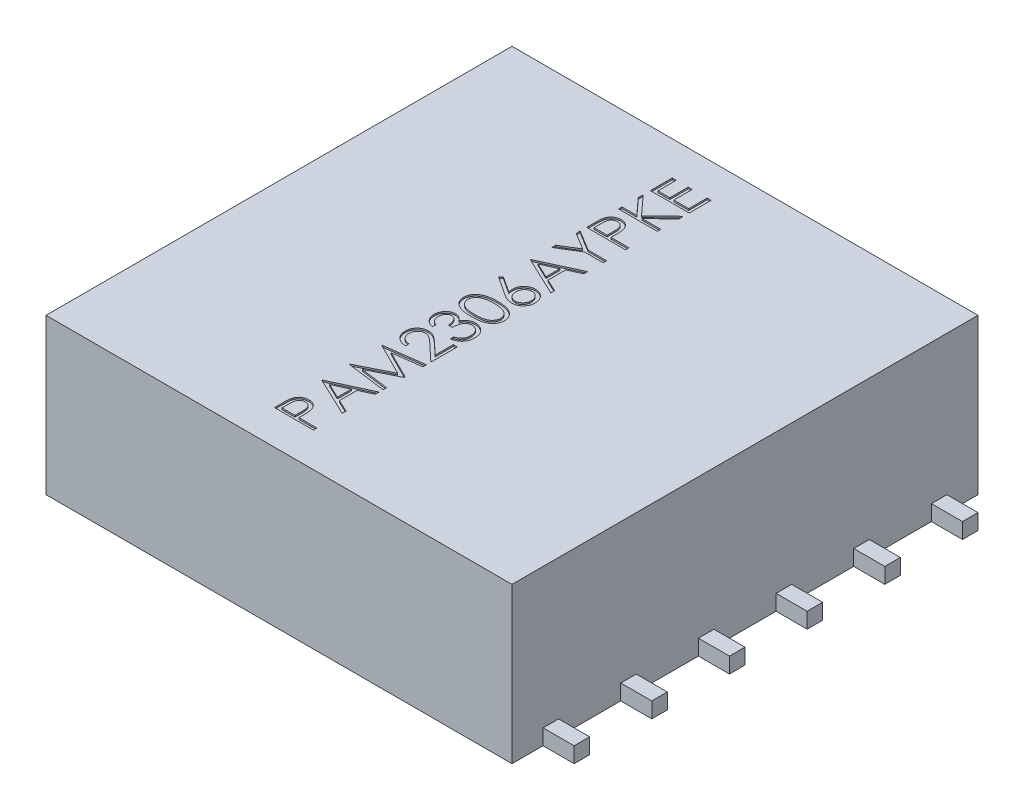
from build123d import *

# Parameters (mm, degrees)
BASES_W                = 3
BASES_H                = 3
BASE_DEPTH             = 1
SOLDERCONNECTIONS_W    = 0.2
SOLDERCONNECTIONS_H    = 0.1
SOLDERCONNECTION_DEPTH = 0.1
SC_LP_COUNT            = 6
SC_LP_PITCH            = 0.5
SC_CP_COUNT            = 2
SC_CP_COPY_1_SKETCH_W  = 0.2
SC_CP_COPY_1_SKETCH_H  = 0.1
SC_CP_COPY_1_DEPTH     = 0.1
SC_CP_COPY_2_SKETCH_W  = 0.2
SC_CP_COPY_2_SKETCH_H  = 0.1
SC_CP_COPY_2_DEPTH     = 0.1
SC_CP_COPY_3_SKETCH_W  = 0.2
SC_CP_COPY_3_SKETCH_H  = 0.1
SC_CP_COPY_3_DEPTH     = 0.1
SC_CP_COPY_4_SKETCH_W  = 0.2
SC_CP_COPY_4_SKETCH_H  = 0.1
SC_CP_COPY_4_DEPTH     = 0.1
SC_CP_COPY_5_SKETCH_W  = 0.2
SC_CP_COPY_5_SKETCH_H  = 0.1
SC_CP_COPY_5_DEPTH     = 0.1
PARTNO_DEPTH           = 0.01


with BuildPart() as part:
    # BaseS → Base (new body)
    with BuildSketch(Plane(origin=(0, 0, 0), x_dir=(1, 0, 0), z_dir=(0, 1, 0))):
        Rectangle(BASES_W, BASES_H)
    extrude(amount=BASE_DEPTH)

    # SolderConnectionS → SolderConnection (add)
    with BuildSketch(Plane(origin=(0, 0, 0), x_dir=(1, 0, 0), z_dir=(0, 1, 0))):
        with Locations((1.6, -1.25)):
            Rectangle(SOLDERCONNECTIONS_W, SOLDERCONNECTIONS_H)
    solderconnection = extrude(amount=SOLDERCONNECTION_DEPTH)

    # SC LP: SolderConnection ×6
    with Locations(*[(0, 0, -i * SC_LP_PITCH) for i in range(1, SC_LP_COUNT)]):
        add(solderconnection)

    # SC CP: SolderConnection ×2 about axis
    sc_cp_axis = Axis((0, 0, 0), (0, 1, 0))
    for i in range(1, SC_CP_COUNT):
        add(solderconnection.rotate(sc_cp_axis, i * 360 / SC_CP_COUNT))

    # SC CP copy 1 sketch → SC CP copy 1 (add)
    with BuildSketch(Plane(origin=(0, 0, 0.5), x_dir=(-1, 0, 0), z_dir=(0, 1, 0))):
        with Locations((1.6, -1.25)):
            Rectangle(SC_CP_COPY_1_SKETCH_W, SC_CP_COPY_1_SKETCH_H)
    extrude(amount=SC_CP_COPY_1_DEPTH)

    # SC CP copy 2 sketch → SC CP copy 2 (add)
    with BuildSketch(Plane(origin=(0, 0, 1), x_dir=(-1, 0, 0), z_dir=(0, 1, 0))):
        with Locations((1.6, -1.25)):
            Rectangle(SC_CP_COPY_2_SKETCH_W, SC_CP_COPY_2_SKETCH_H)
    extrude(amount=SC_CP_COPY_2_DEPTH)

    # SC CP copy 3 sketch → SC CP copy 3 (add)
    with BuildSketch(Plane(origin=(0, 0, 1.5), x_dir=(-1, 0, 0), z_dir=(0, 1, 0))):
        with Locations((1.6, -1.25)):
            Rectangle(SC_CP_COPY_3_SKETCH_W, SC_CP_COPY_3_SKETCH_H)
    extrude(amount=SC_CP_COPY_3_DEPTH)

    # SC CP copy 4 sketch → SC CP copy 4 (add)
    with BuildSketch(Plane(origin=(0, 0, 2), x_dir=(-1, 0, 0), z_dir=(0, 1, 0))):
        with Locations((1.6, -1.25)):
            Rectangle(SC_CP_COPY_4_SKETCH_W, SC_CP_COPY_4_SKETCH_H)
    extrude(amount=SC_CP_COPY_4_DEPTH)

    # SC CP copy 5 sketch → SC CP copy 5 (add)
    with BuildSketch(Plane(origin=(0, 0, 2.5), x_dir=(-1, 0, 0), z_dir=(0, 1, 0))):
        with Locations((1.6, -1.25)):
            Rectangle(SC_CP_COPY_5_SKETCH_W, SC_CP_COPY_5_SKETCH_H)
    extrude(amount=SC_CP_COPY_5_DEPTH)

    # PartNoS → PartNo (cut)
    # profile 1 of 12: a face of its own
    with BuildSketch(Plane(origin=(0, 1, 0), x_dir=(1, 0, 0), z_dir=(0, 1, 0))):
        with BuildLine():
            Line((-0.25, -1.278846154), (-0.25, -1.229817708))
            add(Edge.make_bspline(
                [(-0.25, -1.229817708), (-0.249996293, -1.226445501), (-0.249989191, -1.219984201), (-0.249773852, -1.21071884), (-0.249486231, -1.202303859), (-0.249087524, -1.194757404), (-0.248616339, -1.188056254), (-0.247955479, -1.182230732), (-0.247265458, -1.17723505), (-0.246563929, -1.174241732), (-0.24624399, -1.172876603)],
                knots=[0, 0, 0, 0, 1.415646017, 2.712440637, 3.8905458, 4.950247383, 5.884950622, 6.709939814, 7.411656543, 8, 8, 8, 8], degree=3))
            add(Edge.make_bspline(
                [(-0.24624399, -1.172876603), (-0.245770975, -1.171148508), (-0.244836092, -1.167733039), (-0.242963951, -1.162811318), (-0.240742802, -1.15812971), (-0.238216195, -1.15366732), (-0.23525976, -1.149505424), (-0.232070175, -1.145505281), (-0.228441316, -1.141808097), (-0.224487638, -1.138363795), (-0.220259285, -1.135180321), (-0.215679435, -1.132505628), (-0.210884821, -1.13016696), (-0.205810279, -1.128252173), (-0.200450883, -1.126828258), (-0.194844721, -1.125771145), (-0.188985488, -1.125097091), (-0.184981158, -1.125032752), (-0.182942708, -1.125)],
                knots=[0, 0, 0, 0, 0.999549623, 1.97554611, 2.93413192, 3.889860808, 4.833293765, 5.780583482, 6.742559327, 7.719844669, 8.705620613, 9.691528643, 10.674968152, 11.680406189, 12.713313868, 13.765869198, 14.862690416, 16, 16, 16, 16], degree=3))
            add(Edge.make_bspline(
                [(-0.182942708, -1.125), (-0.180887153, -1.125030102), (-0.17686532, -1.125088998), (-0.170981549, -1.125795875), (-0.165358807, -1.126748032), (-0.160009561, -1.128212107), (-0.154965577, -1.130129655), (-0.150149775, -1.132379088), (-0.145644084, -1.135092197), (-0.141432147, -1.138209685), (-0.13751001, -1.141677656), (-0.133906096, -1.145481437), (-0.130641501, -1.149605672), (-0.127708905, -1.154037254), (-0.125176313, -1.158819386), (-0.122907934, -1.16387954), (-0.121002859, -1.169261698), (-0.120000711, -1.172986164), (-0.119491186, -1.174879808)],
                knots=[0, 0, 0, 0, 1.121902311, 2.195077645, 3.232258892, 4.234102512, 5.217864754, 6.176164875, 7.132989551, 8.084763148, 9.034132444, 9.988522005, 10.94243251, 11.903244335, 12.886203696, 13.894208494, 14.929344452, 16, 16, 16, 16], degree=3))
            add(Edge.make_bspline(
                [(-0.119491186, -1.174879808), (-0.119158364, -1.176446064), (-0.118428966, -1.179878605), (-0.117609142, -1.185531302), (-0.116936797, -1.192116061), (-0.11630936, -1.199610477), (-0.115976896, -1.208032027), (-0.11558653, -1.217361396), (-0.115402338, -1.227630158), (-0.115390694, -1.2347923), (-0.115384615, -1.238531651)],
                knots=[0, 0, 0, 0, 0.601372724, 1.317943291, 2.144091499, 3.08771165, 4.142394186, 5.309582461, 6.595334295, 8, 8, 8, 8], degree=3))
            Line((-0.115384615, -1.238531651), (-0.115384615, -1.256410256))
            Line((-0.115384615, -1.256410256), (0, -1.256410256))
            Line((0, -1.256410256), (0, -1.278846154))
            Line((0, -1.278846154), (-0.25, -1.278846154))
        make_face()
        with BuildLine():
            Line((-0.224358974, -1.256410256), (-0.141025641, -1.256410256))
            Line((-0.141025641, -1.256410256), (-0.14047476, -1.212640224))
            add(Edge.make_bspline(
                [(-0.14047476, -1.212640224), (-0.140473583, -1.210503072), (-0.140471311, -1.206377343), (-0.140756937, -1.200417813), (-0.141082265, -1.1948879), (-0.141574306, -1.189808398), (-0.142219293, -1.185161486), (-0.1430214, -1.180987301), (-0.143893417, -1.177223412), (-0.145350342, -1.172893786), (-0.147590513, -1.168027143), (-0.150851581, -1.162710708), (-0.15507614, -1.158239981), (-0.159812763, -1.154378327), (-0.165067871, -1.151253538), (-0.170720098, -1.149049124), (-0.176685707, -1.147691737), (-0.180765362, -1.147522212), (-0.182842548, -1.147435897)],
                knots=[0, 0, 0, 0, 1.160746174, 2.240796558, 3.240300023, 4.169675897, 5.012224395, 5.787635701, 6.478238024, 7.109103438, 8.265591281, 9.382545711, 10.479929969, 11.588830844, 12.694575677, 13.785760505, 14.872603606, 16, 16, 16, 16], degree=3))
            add(Edge.make_bspline(
                [(-0.182842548, -1.147435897), (-0.18485244, -1.147526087), (-0.188847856, -1.147705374), (-0.194703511, -1.149037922), (-0.200291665, -1.151277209), (-0.205504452, -1.154381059), (-0.210230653, -1.158148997), (-0.214343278, -1.162524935), (-0.217627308, -1.167520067), (-0.219828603, -1.172127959), (-0.221117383, -1.176254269), (-0.222048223, -1.179820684), (-0.2226901, -1.183868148), (-0.223304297, -1.188358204), (-0.223800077, -1.193285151), (-0.224144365, -1.198680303), (-0.224343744, -1.204525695), (-0.224353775, -1.208583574), (-0.224358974, -1.210687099)],
                knots=[0, 0, 0, 0, 1.120540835, 2.227496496, 3.330685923, 4.466139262, 5.598993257, 6.692710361, 7.80064471, 8.921224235, 9.527843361, 10.209888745, 10.975318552, 11.811557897, 12.738105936, 13.73658638, 14.826690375, 16, 16, 16, 16], degree=3))
            Line((-0.224358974, -1.210687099), (-0.224358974, -1.256410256))
        make_face(mode=Mode.SUBTRACT)
    # profile 2 of 12: a face of its own
    with BuildSketch(Plane(origin=(0, 1, 0), x_dir=(1, 0, 0), z_dir=(0, 1, 0))):
        Polygon((-0.25, -0.971153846), (0, -0.855769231), (0, -0.880158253), (-0.080128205, -0.917117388), (-0.080128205, -1.030448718), (0, -1.068459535), (0, -1.092948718), (-0.25, -0.974358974), align=None)
        Polygon((-0.201272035, -0.973006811), (-0.105769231, -1.018279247), (-0.105769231, -0.928936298), align=None, mode=Mode.SUBTRACT)
    # profile 3 of 12: a face of its own
    with BuildSketch(Plane(origin=(0, 1, 0), x_dir=(1, 0, 0), z_dir=(0, 1, 0))):
        Polygon((0, -0.830128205), (-0.25, -0.797125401), (-0.25, -0.793920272), (-0.044871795, -0.690705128), (-0.25, -0.587740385), (-0.25, -0.584485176), (0, -0.551282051), (0, -0.573818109), (-0.179887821, -0.59775641), (0, -0.688000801), (0, -0.693058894), (-0.180288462, -0.783653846), (0, -0.807542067), align=None)
    # profile 4 of 12: a face of its own
    with BuildSketch(Plane(origin=(0, 1, 0), x_dir=(1, 0, 0), z_dir=(0, 1, 0))):
        with BuildLine():
            Line((-0.173076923, -0.490384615), (-0.173076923, -0.512820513))
            add(Edge.make_bspline(
                [(-0.173076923, -0.512820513), (-0.176053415, -0.512674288), (-0.181899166, -0.512387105), (-0.190422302, -0.511042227), (-0.198569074, -0.509117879), (-0.206274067, -0.506397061), (-0.213605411, -0.503018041), (-0.220533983, -0.498965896), (-0.227033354, -0.494166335), (-0.233043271, -0.488722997), (-0.238556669, -0.482810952), (-0.243317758, -0.476431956), (-0.247340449, -0.46972874), (-0.250703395, -0.46272164), (-0.253227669, -0.4553316), (-0.255100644, -0.447625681), (-0.256227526, -0.439570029), (-0.256348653, -0.434081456), (-0.256410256, -0.431290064)],
                knots=[0, 0, 0, 0, 1.10065271, 2.161652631, 3.183658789, 4.190468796, 5.17591951, 6.163126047, 7.15150782, 8.156236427, 9.156009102, 10.134482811, 11.092018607, 12.041330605, 13.001268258, 13.972401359, 14.968799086, 16, 16, 16, 16], degree=3))
            add(Edge.make_bspline(
                [(-0.256410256, -0.431290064), (-0.256346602, -0.42854858), (-0.256221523, -0.423161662), (-0.255131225, -0.415302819), (-0.25346044, -0.407803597), (-0.250984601, -0.400748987), (-0.247877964, -0.394066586), (-0.244014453, -0.387839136), (-0.239576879, -0.381916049), (-0.234342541, -0.37658802), (-0.22875749, -0.371693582), (-0.222792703, -0.367474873), (-0.216624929, -0.363841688), (-0.210205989, -0.360868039), (-0.20351498, -0.358613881), (-0.196616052, -0.356943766), (-0.189429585, -0.355989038), (-0.184564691, -0.355843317), (-0.182091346, -0.355769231)],
                knots=[0, 0, 0, 0, 1.111674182, 2.184400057, 3.212814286, 4.223731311, 5.211378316, 6.196328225, 7.191884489, 8.207283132, 9.220262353, 10.201199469, 11.166417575, 12.120932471, 13.06540007, 14.026332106, 14.996573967, 16, 16, 16, 16], degree=3))
            add(Edge.make_bspline(
                [(-0.182091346, -0.355769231), (-0.178609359, -0.35589018), (-0.17170649, -0.356129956), (-0.161562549, -0.358180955), (-0.151734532, -0.361384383), (-0.143824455, -0.365240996), (-0.137451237, -0.369132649), (-0.132201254, -0.372636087), (-0.126549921, -0.376760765), (-0.120474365, -0.381471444), (-0.114054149, -0.386849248), (-0.107158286, -0.392754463), (-0.099914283, -0.399339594), (-0.094963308, -0.403957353), (-0.092397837, -0.40635016)],
                knots=[0, 0, 0, 0, 1.184416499, 2.348048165, 3.509039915, 4.696071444, 5.333504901, 6.05069495, 6.844171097, 7.714965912, 8.667477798, 9.695072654, 10.805644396, 12, 12, 12, 12], degree=3))
            Line((-0.092397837, -0.40635016), (-0.025641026, -0.46890024))
            Line((-0.025641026, -0.46890024), (-0.025641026, -0.352564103))
            Line((-0.025641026, -0.352564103), (0, -0.352564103))
            Line((0, -0.352564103), (0, -0.522435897))
            Line((0, -0.522435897), (-0.103465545, -0.425480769))
            add(Edge.make_bspline(
                [(-0.103465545, -0.425480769), (-0.10592971, -0.423120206), (-0.110662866, -0.418586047), (-0.117573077, -0.412173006), (-0.123983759, -0.406413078), (-0.129882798, -0.401268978), (-0.135356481, -0.396852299), (-0.140227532, -0.392932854), (-0.144709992, -0.389792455), (-0.14990575, -0.386384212), (-0.156249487, -0.383083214), (-0.164001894, -0.380246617), (-0.171982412, -0.378516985), (-0.177375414, -0.378309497), (-0.180088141, -0.378205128)],
                knots=[0, 0, 0, 0, 1.329631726, 2.553950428, 3.673215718, 4.687767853, 5.603093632, 6.413772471, 7.123043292, 7.734684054, 8.834405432, 9.900288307, 10.943827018, 12, 12, 12, 12], degree=3))
            add(Edge.make_bspline(
                [(-0.180088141, -0.378205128), (-0.181793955, -0.378250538), (-0.185155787, -0.378340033), (-0.19008477, -0.379129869), (-0.1948394, -0.380323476), (-0.199434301, -0.382033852), (-0.203823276, -0.384291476), (-0.208011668, -0.387039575), (-0.212060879, -0.390210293), (-0.215857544, -0.393878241), (-0.219334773, -0.397907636), (-0.222415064, -0.402164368), (-0.224989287, -0.406667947), (-0.227099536, -0.411399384), (-0.228754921, -0.416345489), (-0.229901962, -0.421515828), (-0.23062214, -0.426896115), (-0.23071958, -0.430569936), (-0.230769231, -0.432441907)],
                knots=[0, 0, 0, 0, 0.991446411, 1.95395049, 2.89581595, 3.838931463, 4.798493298, 5.75982156, 6.748411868, 7.785213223, 8.824556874, 9.840280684, 10.836137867, 11.835679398, 12.848801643, 13.863922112, 14.911575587, 16, 16, 16, 16], degree=3))
            add(Edge.make_bspline(
                [(-0.230769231, -0.432441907), (-0.230720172, -0.434397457), (-0.23062383, -0.438237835), (-0.229894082, -0.443864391), (-0.228787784, -0.449268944), (-0.227030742, -0.454370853), (-0.22495471, -0.459280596), (-0.222317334, -0.463893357), (-0.219252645, -0.468285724), (-0.215699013, -0.47238545), (-0.211706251, -0.476129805), (-0.207305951, -0.47946597), (-0.202529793, -0.482361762), (-0.197397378, -0.484891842), (-0.191857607, -0.486945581), (-0.185931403, -0.48851516), (-0.179644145, -0.489757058), (-0.175302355, -0.490171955), (-0.173076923, -0.490384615)],
                knots=[0, 0, 0, 0, 1.030878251, 2.024474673, 2.987898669, 3.934362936, 4.864849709, 5.795128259, 6.730474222, 7.685293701, 8.650606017, 9.611896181, 10.591709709, 11.591680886, 12.625074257, 13.701333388, 14.821793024, 16, 16, 16, 16], degree=3))
        make_face()
    # profile 5 of 12: a face of its own
    with BuildSketch(Plane(origin=(0, 1, 0), x_dir=(1, 0, 0), z_dir=(0, 1, 0))):
        with BuildLine():
            Line((-0.192307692, -0.298076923), (-0.192307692, -0.320512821))
            add(Edge.make_bspline(
                [(-0.192307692, -0.320512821), (-0.194824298, -0.319904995), (-0.199744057, -0.318716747), (-0.206773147, -0.316238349), (-0.213424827, -0.313538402), (-0.219574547, -0.310296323), (-0.225345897, -0.306759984), (-0.230607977, -0.302708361), (-0.235494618, -0.298328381), (-0.239831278, -0.293483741), (-0.243758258, -0.288403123), (-0.247106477, -0.283014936), (-0.249986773, -0.277427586), (-0.252359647, -0.271602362), (-0.254147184, -0.265521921), (-0.255444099, -0.259241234), (-0.256286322, -0.252743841), (-0.256368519, -0.248333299), (-0.256410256, -0.24609375)],
                knots=[0, 0, 0, 0, 1.162005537, 2.271625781, 3.343758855, 4.383309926, 5.390229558, 6.379919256, 7.361854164, 8.333198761, 9.295911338, 10.242430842, 11.177959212, 12.116337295, 13.062827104, 14.020064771, 14.994644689, 16, 16, 16, 16], degree=3))
            add(Edge.make_bspline(
                [(-0.256410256, -0.24609375), (-0.25631174, -0.242830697), (-0.256116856, -0.236375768), (-0.254337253, -0.226892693), (-0.251521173, -0.21774792), (-0.247630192, -0.209041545), (-0.242831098, -0.200954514), (-0.237119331, -0.193759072), (-0.230605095, -0.18755275), (-0.223409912, -0.182346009), (-0.215720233, -0.178269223), (-0.207805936, -0.175263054), (-0.199685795, -0.173432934), (-0.194203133, -0.173195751), (-0.19145633, -0.173076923)],
                knots=[0, 0, 0, 0, 1.083050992, 2.142477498, 3.193116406, 4.255571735, 5.30263384, 6.308962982, 7.297363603, 8.282367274, 9.249857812, 10.179914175, 11.08814088, 12, 12, 12, 12], degree=3))
            add(Edge.make_bspline(
                [(-0.19145633, -0.173076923), (-0.188812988, -0.173160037), (-0.183640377, -0.173322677), (-0.176088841, -0.174703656), (-0.168971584, -0.177027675), (-0.162258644, -0.180246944), (-0.155992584, -0.184414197), (-0.150159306, -0.189462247), (-0.144732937, -0.195426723), (-0.141624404, -0.199946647), (-0.140024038, -0.202273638)],
                knots=[0, 0, 0, 0, 1.024540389, 2.004866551, 2.965041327, 3.920577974, 4.882998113, 5.874504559, 6.905732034, 8, 8, 8, 8], degree=3))
            add(Edge.make_bspline(
                [(-0.140024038, -0.202273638), (-0.138744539, -0.199610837), (-0.136205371, -0.194326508), (-0.131146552, -0.187196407), (-0.125449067, -0.180625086), (-0.120953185, -0.177003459), (-0.118689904, -0.175180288)],
                knots=[0, 0, 0, 0, 1.015663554, 2.015584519, 3.001021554, 4, 4, 4, 4], degree=3))
            add(Edge.make_bspline(
                [(-0.118689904, -0.175180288), (-0.117042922, -0.173977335), (-0.113775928, -0.171591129), (-0.108523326, -0.168645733), (-0.103212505, -0.165973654), (-0.097701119, -0.163891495), (-0.092053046, -0.162279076), (-0.08625859, -0.161126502), (-0.080313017, -0.160410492), (-0.076290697, -0.160307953), (-0.07426883, -0.16025641)],
                knots=[0, 0, 0, 0, 1.025084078, 2.033381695, 3.024893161, 4.013698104, 4.991890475, 5.976764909, 6.982997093, 8, 8, 8, 8], degree=3))
            add(Edge.make_bspline(
                [(-0.07426883, -0.16025641), (-0.070768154, -0.160384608), (-0.063783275, -0.160640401), (-0.053463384, -0.162926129), (-0.043376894, -0.166471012), (-0.033724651, -0.17149948), (-0.024702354, -0.17765549), (-0.016570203, -0.184898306), (-0.009689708, -0.193331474), (-0.003871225, -0.20264936), (0.000736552, -0.212787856), (0.004057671, -0.223587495), (0.006049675, -0.234985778), (0.006288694, -0.242780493), (0.006410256, -0.246744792)],
                knots=[0, 0, 0, 0, 0.955697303, 1.906897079, 2.875188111, 3.870982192, 4.871999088, 5.854111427, 6.836107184, 7.836239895, 8.848948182, 9.870701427, 10.917064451, 12, 12, 12, 12], degree=3))
            add(Edge.make_bspline(
                [(0.006410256, -0.246744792), (0.0063477, -0.249417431), (0.006224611, -0.254676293), (0.005398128, -0.262410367), (0.003847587, -0.269777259), (0.001897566, -0.276848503), (-0.000798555, -0.283517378), (-0.004012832, -0.289879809), (-0.007827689, -0.295907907), (-0.012249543, -0.301565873), (-0.017199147, -0.306847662), (-0.022758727, -0.311618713), (-0.028824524, -0.315931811), (-0.0354511, -0.319759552), (-0.042619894, -0.323118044), (-0.050359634, -0.325935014), (-0.058610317, -0.328394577), (-0.064358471, -0.329540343), (-0.067307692, -0.330128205)],
                knots=[0, 0, 0, 0, 1.048603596, 2.063302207, 3.045874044, 3.999447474, 4.937100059, 5.862643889, 6.7929026, 7.7308982, 8.676022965, 9.627908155, 10.600123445, 11.591992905, 12.626222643, 13.701663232, 14.820785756, 16, 16, 16, 16], degree=3))
            Line((-0.067307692, -0.330128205), (-0.067307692, -0.307692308))
            add(Edge.make_bspline(
                [(-0.067307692, -0.307692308), (-0.065382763, -0.307107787), (-0.061638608, -0.305970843), (-0.056250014, -0.304035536), (-0.051310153, -0.30183066), (-0.046782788, -0.299465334), (-0.04262333, -0.296981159), (-0.038941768, -0.294201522), (-0.035576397, -0.291332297), (-0.033680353, -0.289169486), (-0.032752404, -0.288110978)],
                knots=[0, 0, 0, 0, 1.198163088, 2.33053128, 3.407730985, 4.417276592, 5.372219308, 6.28897303, 7.162600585, 8, 8, 8, 8], degree=3))
            add(Edge.make_bspline(
                [(-0.032752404, -0.288110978), (-0.031673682, -0.286711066), (-0.029519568, -0.283915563), (-0.026762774, -0.279363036), (-0.024403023, -0.27455842), (-0.022484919, -0.269461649), (-0.021045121, -0.264072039), (-0.020008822, -0.258411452), (-0.019324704, -0.252470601), (-0.019262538, -0.248416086), (-0.019230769, -0.246344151)],
                knots=[0, 0, 0, 0, 0.946083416, 1.889246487, 2.84504177, 3.809995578, 4.801312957, 5.829064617, 6.89060985, 8, 8, 8, 8], degree=3))
            add(Edge.make_bspline(
                [(-0.019230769, -0.246344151), (-0.019274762, -0.244004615), (-0.019360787, -0.239429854), (-0.020151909, -0.232754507), (-0.021304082, -0.226403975), (-0.023083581, -0.220448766), (-0.025282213, -0.214810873), (-0.028042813, -0.209569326), (-0.031281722, -0.204655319), (-0.03496309, -0.20013179), (-0.038993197, -0.196064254), (-0.043208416, -0.19248286), (-0.047590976, -0.189438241), (-0.052165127, -0.186982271), (-0.056911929, -0.185042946), (-0.061844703, -0.183722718), (-0.066923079, -0.182804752), (-0.070375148, -0.182729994), (-0.072115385, -0.182692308)],
                knots=[0, 0, 0, 0, 1.217147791, 2.380027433, 3.494444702, 4.572153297, 5.609568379, 6.639424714, 7.649109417, 8.668170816, 9.669597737, 10.625200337, 11.543417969, 12.441394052, 13.322311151, 14.205496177, 15.095365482, 16, 16, 16, 16], degree=3))
            add(Edge.make_bspline(
                [(-0.072115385, -0.182692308), (-0.074444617, -0.182801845), (-0.079091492, -0.183020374), (-0.085930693, -0.184681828), (-0.092522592, -0.187439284), (-0.098781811, -0.191223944), (-0.104512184, -0.195943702), (-0.1096616, -0.201375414), (-0.11390661, -0.207666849), (-0.116842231, -0.213453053), (-0.118844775, -0.21857927), (-0.120178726, -0.222966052), (-0.121308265, -0.227877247), (-0.122359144, -0.233253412), (-0.123253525, -0.239135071), (-0.123999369, -0.245515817), (-0.124596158, -0.252396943), (-0.124862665, -0.257160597), (-0.125, -0.259615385)],
                knots=[0, 0, 0, 0, 1.070505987, 2.135685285, 3.216438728, 4.346150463, 5.486482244, 6.621737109, 7.7759408, 8.963942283, 9.59839197, 10.305095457, 11.070459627, 11.915156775, 12.823989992, 13.805807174, 14.869297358, 16, 16, 16, 16], degree=3))
            Line((-0.125, -0.259615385), (-0.150641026, -0.259615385))
            add(Edge.make_bspline(
                [(-0.150641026, -0.259615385), (-0.150701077, -0.256523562), (-0.150818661, -0.250469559), (-0.151955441, -0.241602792), (-0.153780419, -0.233160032), (-0.156387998, -0.225262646), (-0.159459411, -0.218078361), (-0.163008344, -0.21182038), (-0.167025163, -0.206653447), (-0.171432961, -0.202523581), (-0.176134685, -0.199384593), (-0.181065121, -0.197127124), (-0.186243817, -0.19578167), (-0.189779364, -0.195602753), (-0.19155649, -0.195512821)],
                knots=[0, 0, 0, 0, 1.322091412, 2.58874672, 3.817242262, 5.011895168, 6.140903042, 7.155122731, 8.080855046, 8.929742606, 9.727943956, 10.488587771, 11.240295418, 12, 12, 12, 12], degree=3))
            add(Edge.make_bspline(
                [(-0.19155649, -0.195512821), (-0.192862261, -0.195541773), (-0.195460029, -0.195599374), (-0.199267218, -0.196354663), (-0.202957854, -0.197437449), (-0.206489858, -0.199009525), (-0.209870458, -0.201046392), (-0.213136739, -0.203503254), (-0.216246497, -0.206450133), (-0.219215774, -0.209750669), (-0.221916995, -0.213405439), (-0.224281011, -0.21732919), (-0.226286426, -0.221506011), (-0.227945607, -0.225909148), (-0.229192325, -0.230559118), (-0.230087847, -0.235432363), (-0.23064765, -0.240538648), (-0.230728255, -0.24402234), (-0.230769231, -0.245793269)],
                knots=[0, 0, 0, 0, 0.884325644, 1.759323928, 2.622595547, 3.489424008, 4.37295195, 5.294616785, 6.255907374, 7.274251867, 8.302369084, 9.333474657, 10.37669385, 11.44084034, 12.520297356, 13.637342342, 14.798947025, 16, 16, 16, 16], degree=3))
            add(Edge.make_bspline(
                [(-0.230769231, -0.245793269), (-0.230669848, -0.248639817), (-0.23047573, -0.254199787), (-0.228775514, -0.262215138), (-0.226062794, -0.269666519), (-0.222824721, -0.275362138), (-0.219628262, -0.279568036), (-0.216836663, -0.282573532), (-0.213734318, -0.285524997), (-0.210130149, -0.288228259), (-0.206268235, -0.290962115), (-0.201952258, -0.293451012), (-0.197294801, -0.295869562), (-0.194002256, -0.297326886), (-0.192307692, -0.298076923)],
                knots=[0, 0, 0, 0, 1.472543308, 2.876219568, 4.221790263, 5.565193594, 6.249813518, 6.953379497, 7.687249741, 8.463570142, 9.283606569, 10.136032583, 11.040678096, 12, 12, 12, 12], degree=3))
        make_face()
    # profile 6 of 12: a face of its own
    with BuildSketch(Plane(origin=(0, 1, 0), x_dir=(1, 0, 0), z_dir=(0, 1, 0))):
        with BuildLine():
            add(Edge.make_bspline(
                [(-0.12489984, -0.137820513), (-0.128906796, -0.137797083), (-0.136690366, -0.13775157), (-0.148032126, -0.137245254), (-0.158672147, -0.136404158), (-0.168610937, -0.135251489), (-0.177851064, -0.133848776), (-0.186367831, -0.131976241), (-0.194200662, -0.129846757), (-0.201375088, -0.127378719), (-0.207987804, -0.124593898), (-0.214160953, -0.121562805), (-0.219885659, -0.118165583), (-0.225251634, -0.114594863), (-0.230176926, -0.110711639), (-0.234718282, -0.106599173), (-0.238837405, -0.102175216), (-0.242537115, -0.097482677), (-0.245781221, -0.092553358), (-0.248656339, -0.08752196), (-0.251024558, -0.082298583), (-0.252961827, -0.076951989), (-0.254543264, -0.07147091), (-0.255629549, -0.065856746), (-0.256311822, -0.060096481), (-0.256377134, -0.056208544), (-0.256410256, -0.054236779)],
                knots=[0, 0, 0, 0, 1.646148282, 3.197666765, 4.66315463, 6.030252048, 7.307778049, 8.501004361, 9.610818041, 10.641065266, 11.615491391, 12.557119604, 13.464013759, 14.348536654, 15.203310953, 16.038349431, 16.863300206, 17.683791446, 18.490318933, 19.285717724, 20.06220424, 20.843281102, 21.620494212, 22.403315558, 23.190242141, 24, 24, 24, 24], degree=3))
            add(Edge.make_bspline(
                [(-0.256410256, -0.054236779), (-0.256382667, -0.052247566), (-0.256327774, -0.048289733), (-0.255555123, -0.042459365), (-0.254557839, -0.036730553), (-0.252958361, -0.031190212), (-0.251044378, -0.025733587), (-0.248518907, -0.020496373), (-0.245772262, -0.015293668), (-0.242421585, -0.010361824), (-0.238718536, -0.005553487), (-0.234514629, -0.001046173), (-0.229926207, 0.003275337), (-0.224850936, 0.007247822), (-0.219366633, 0.011041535), (-0.213427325, 0.014512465), (-0.207046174, 0.017732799), (-0.200252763, 0.020763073), (-0.192865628, 0.023412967), (-0.184930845, 0.025768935), (-0.176376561, 0.027700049), (-0.167250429, 0.029297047), (-0.157507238, 0.030536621), (-0.147166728, 0.031438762), (-0.136222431, 0.031915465), (-0.128739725, 0.032005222), (-0.12489984, 0.032051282)],
                knots=[0, 0, 0, 0, 0.810910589, 1.61342667, 2.396193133, 3.181089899, 3.963115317, 4.752255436, 5.550715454, 6.36105385, 7.181178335, 8.024612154, 8.872680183, 9.750181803, 10.651284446, 11.591556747, 12.554036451, 13.566402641, 14.62422919, 15.753422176, 16.94128843, 18.199818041, 19.531985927, 20.947085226, 22.433341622, 24, 24, 24, 24], degree=3))
            add(Edge.make_bspline(
                [(-0.12489984, 0.032051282), (-0.121076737, 0.032004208), (-0.113610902, 0.031912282), (-0.102715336, 0.031448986), (-0.092430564, 0.030514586), (-0.082745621, 0.02936282), (-0.073656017, 0.027747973), (-0.065167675, 0.025802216), (-0.057250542, 0.023585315), (-0.049961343, 0.020894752), (-0.04317972, 0.01793501), (-0.03684549, 0.014718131), (-0.03090775, 0.011266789), (-0.025408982, 0.007529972), (-0.020354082, 0.003492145), (-0.015749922, -0.000826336), (-0.011519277, -0.005373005), (-0.007775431, -0.010209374), (-0.004399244, -0.015187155), (-0.001552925, -0.020390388), (0.000913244, -0.02568591), (0.002929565, -0.03112659), (0.004493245, -0.036704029), (0.00556819, -0.042436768), (0.006323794, -0.048290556), (0.006381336, -0.052247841), (0.006410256, -0.054236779)],
                knots=[0, 0, 0, 0, 1.561645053, 3.049612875, 4.452756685, 5.778837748, 7.032101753, 8.221335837, 9.334924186, 10.387562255, 11.392109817, 12.355697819, 13.287721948, 14.19548756, 15.068665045, 15.927346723, 16.771751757, 17.602390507, 18.423119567, 19.225778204, 20.022010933, 20.807278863, 21.593079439, 22.384715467, 23.188155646, 24, 24, 24, 24], degree=3))
            add(Edge.make_bspline(
                [(0.006410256, -0.054236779), (0.006376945, -0.056208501), (0.006311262, -0.060096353), (0.00563171, -0.065857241), (0.004539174, -0.071448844), (0.003009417, -0.076898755), (0.001136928, -0.082234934), (-0.001302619, -0.087384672), (-0.004112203, -0.092405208), (-0.007311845, -0.097283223), (-0.010977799, -0.101926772), (-0.015031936, -0.106363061), (-0.019578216, -0.110476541), (-0.024545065, -0.114326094), (-0.029919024, -0.117934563), (-0.0357037, -0.121302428), (-0.041908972, -0.124397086), (-0.048573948, -0.127229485), (-0.055799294, -0.129740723), (-0.063652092, -0.131950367), (-0.072212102, -0.133715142), (-0.081435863, -0.135211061), (-0.091342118, -0.136409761), (-0.10193445, -0.137244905), (-0.113192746, -0.137751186), (-0.120926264, -0.137796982), (-0.12489984, -0.137820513)],
                knots=[0, 0, 0, 0, 0.810927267, 1.598990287, 2.382942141, 3.152806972, 3.926217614, 4.706701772, 5.493896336, 6.292070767, 7.104102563, 7.925577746, 8.761822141, 9.623241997, 10.509042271, 11.423174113, 12.375371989, 13.360203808, 14.400680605, 15.520553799, 16.714061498, 17.994519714, 19.364400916, 20.818312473, 22.365209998, 24, 24, 24, 24], degree=3))
        make_face()
        with BuildLine():
            add(Edge.make_bspline(
                [(-0.125, -0.115384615), (-0.121660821, -0.115375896), (-0.115180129, -0.115358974), (-0.105779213, -0.114929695), (-0.096996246, -0.114332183), (-0.088834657, -0.113580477), (-0.081322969, -0.112454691), (-0.074429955, -0.111177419), (-0.068168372, -0.109645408), (-0.062483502, -0.107823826), (-0.057294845, -0.105748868), (-0.052464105, -0.103487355), (-0.047934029, -0.101036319), (-0.043715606, -0.098345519), (-0.039860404, -0.095361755), (-0.036270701, -0.092223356), (-0.033071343, -0.088788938), (-0.029233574, -0.084038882), (-0.025267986, -0.077767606), (-0.021814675, -0.069866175), (-0.019644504, -0.061746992), (-0.019368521, -0.056236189), (-0.019230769, -0.053485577)],
                knots=[0, 0, 0, 0, 1.459098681, 2.831824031, 4.11146945, 5.306290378, 6.412266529, 7.42953815, 8.369053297, 9.227277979, 10.03601793, 10.809473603, 11.557037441, 12.285528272, 12.993193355, 13.685654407, 14.36688038, 15.041354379, 16.352855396, 17.594313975, 18.799247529, 20, 20, 20, 20], degree=3))
            add(Edge.make_bspline(
                [(-0.019230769, -0.053485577), (-0.019351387, -0.050719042), (-0.019592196, -0.045195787), (-0.021693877, -0.037084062), (-0.025110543, -0.029274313), (-0.029014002, -0.023110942), (-0.032755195, -0.018434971), (-0.035941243, -0.015083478), (-0.039509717, -0.012007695), (-0.043359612, -0.009090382), (-0.047564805, -0.00641474), (-0.052104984, -0.003981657), (-0.056992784, -0.001761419), (-0.060404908, -0.000496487), (-0.062149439, 0.00015024)],
                knots=[0, 0, 0, 0, 1.353621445, 2.702441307, 4.075953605, 5.516772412, 6.261413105, 7.007624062, 7.778524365, 8.566925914, 9.372323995, 10.217594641, 11.088702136, 12, 12, 12, 12], degree=3))
            add(Edge.make_bspline(
                [(-0.062149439, 0.00015024), (-0.064380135, 0.000903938), (-0.068909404, 0.002434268), (-0.075935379, 0.004406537), (-0.083307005, 0.00595978), (-0.090980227, 0.007357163), (-0.099011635, 0.008310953), (-0.107376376, 0.009078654), (-0.116080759, 0.009530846), (-0.121994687, 0.0095869), (-0.125, 0.009615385)],
                knots=[0, 0, 0, 0, 0.884706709, 1.796334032, 2.740027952, 3.714592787, 4.726048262, 5.777819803, 6.87074269, 8, 8, 8, 8], degree=3))
            add(Edge.make_bspline(
                [(-0.125, 0.009615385), (-0.128004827, 0.009576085), (-0.13388291, 0.009499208), (-0.142491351, 0.009205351), (-0.15066762, 0.008446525), (-0.158446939, 0.00760373), (-0.165786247, 0.006361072), (-0.172746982, 0.005021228), (-0.179242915, 0.003221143), (-0.185375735, 0.001298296), (-0.191075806, -0.000902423), (-0.196369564, -0.003325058), (-0.201283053, -0.00591204), (-0.205801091, -0.0087232), (-0.209949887, -0.01171938), (-0.213633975, -0.015008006), (-0.217032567, -0.018380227), (-0.220842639, -0.023176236), (-0.224758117, -0.029404), (-0.228263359, -0.037206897), (-0.230337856, -0.045282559), (-0.230625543, -0.050753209), (-0.230769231, -0.053485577)],
                knots=[0, 0, 0, 0, 1.313483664, 2.569454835, 3.763100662, 4.901599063, 5.988328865, 7.015709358, 7.99797933, 8.932480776, 9.824041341, 10.666387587, 11.475829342, 12.24921787, 12.990555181, 13.709176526, 14.405678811, 15.080244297, 16.38186033, 17.610124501, 18.806354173, 20, 20, 20, 20], degree=3))
            add(Edge.make_bspline(
                [(-0.230769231, -0.053485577), (-0.230625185, -0.056251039), (-0.230336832, -0.061787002), (-0.228272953, -0.069948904), (-0.224768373, -0.077804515), (-0.220850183, -0.084052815), (-0.217047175, -0.088790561), (-0.213810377, -0.092152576), (-0.210306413, -0.095334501), (-0.20641701, -0.098241), (-0.202213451, -0.100915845), (-0.197741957, -0.103461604), (-0.192902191, -0.105692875), (-0.187717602, -0.107774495), (-0.18203242, -0.109599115), (-0.17574818, -0.111113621), (-0.168838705, -0.112492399), (-0.161272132, -0.113485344), (-0.153108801, -0.114359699), (-0.144303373, -0.114923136), (-0.134870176, -0.115360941), (-0.128355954, -0.115376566), (-0.125, -0.115384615)],
                knots=[0, 0, 0, 0, 1.207546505, 2.417292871, 3.651582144, 4.952510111, 5.626719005, 6.30238548, 6.989136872, 7.692112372, 8.420316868, 9.164734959, 9.937886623, 10.746308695, 11.604196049, 12.543341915, 13.568754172, 14.680483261, 15.875568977, 17.154711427, 18.534182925, 20, 20, 20, 20], degree=3))
        make_face(mode=Mode.SUBTRACT)
    # profile 7 of 12: a face of its own
    with BuildSketch(Plane(origin=(0, 1, 0), x_dir=(1, 0, 0), z_dir=(0, 1, 0))):
        with BuildLine():
            Line((-0.256410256, 0.169871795), (-0.242838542, 0.187149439))
            Line((-0.242838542, 0.187149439), (-0.141826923, 0.12109375))
            add(Edge.make_bspline(
                [(-0.141826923, 0.12109375), (-0.142527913, 0.125491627), (-0.143895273, 0.134070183), (-0.144120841, 0.142753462), (-0.144230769, 0.146985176)],
                knots=[0, 0, 0, 0, 1.025318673, 2, 2, 2, 2], degree=3))
            add(Edge.make_bspline(
                [(-0.144230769, 0.146985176), (-0.144162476, 0.149526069), (-0.144028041, 0.15452774), (-0.142993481, 0.161871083), (-0.141363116, 0.168927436), (-0.138986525, 0.17566755), (-0.135950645, 0.182115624), (-0.132312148, 0.188308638), (-0.127883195, 0.194130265), (-0.122935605, 0.19965514), (-0.117456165, 0.204672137), (-0.111640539, 0.20911048), (-0.105489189, 0.21285903), (-0.099003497, 0.215845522), (-0.092234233, 0.218232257), (-0.085154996, 0.219931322), (-0.077753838, 0.220947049), (-0.072719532, 0.221084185), (-0.07016226, 0.221153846)],
                knots=[0, 0, 0, 0, 1.043709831, 2.054511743, 3.041122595, 4.01515914, 4.98481438, 5.965901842, 6.960491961, 7.985277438, 9.0096037, 10.00832444, 10.987059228, 11.962929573, 12.936966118, 13.931840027, 14.949438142, 16, 16, 16, 16], degree=3))
            add(Edge.make_bspline(
                [(-0.07016226, 0.221153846), (-0.066663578, 0.221052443), (-0.059779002, 0.220852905), (-0.049753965, 0.218856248), (-0.040209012, 0.215776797), (-0.031309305, 0.211304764), (-0.022993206, 0.205855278), (-0.015648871, 0.199128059), (-0.009098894, 0.191456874), (-0.003624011, 0.182778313), (0.000847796, 0.173439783), (0.004059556, 0.163628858), (0.006036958, 0.153441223), (0.006284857, 0.146526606), (0.006410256, 0.143028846)],
                knots=[0, 0, 0, 0, 1.031403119, 2.029557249, 3.004870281, 3.983165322, 4.960181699, 5.929903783, 6.912123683, 7.928973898, 8.949315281, 9.960468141, 10.968302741, 12, 12, 12, 12], degree=3))
            add(Edge.make_bspline(
                [(0.006410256, 0.143028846), (0.006301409, 0.139664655), (0.006085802, 0.13300078), (0.004155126, 0.123200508), (0.001048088, 0.113766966), (-0.003322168, 0.104821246), (-0.008749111, 0.096520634), (-0.015236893, 0.08903515), (-0.022794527, 0.082565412), (-0.031256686, 0.07713278), (-0.040337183, 0.07280569), (-0.049821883, 0.069591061), (-0.059670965, 0.067703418), (-0.066348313, 0.067440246), (-0.069711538, 0.067307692)],
                knots=[0, 0, 0, 0, 1.012172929, 2.004937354, 2.995255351, 3.995689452, 4.993936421, 5.973737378, 6.968231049, 7.979117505, 8.993136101, 9.989812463, 10.987515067, 12, 12, 12, 12], degree=3))
            add(Edge.make_bspline(
                [(-0.069711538, 0.067307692), (-0.072286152, 0.067392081), (-0.07754302, 0.067564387), (-0.085504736, 0.068767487), (-0.093651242, 0.070700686), (-0.100562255, 0.072865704), (-0.106223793, 0.075153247), (-0.110788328, 0.077057), (-0.115485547, 0.079426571), (-0.120476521, 0.081953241), (-0.125632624, 0.084864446), (-0.131040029, 0.08802985), (-0.136612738, 0.091536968), (-0.140394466, 0.093995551), (-0.142327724, 0.095252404)],
                knots=[0, 0, 0, 0, 1.173818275, 2.396712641, 3.66331629, 4.989737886, 5.693666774, 6.447286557, 7.243889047, 8.091586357, 8.998013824, 9.943181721, 10.948533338, 12, 12, 12, 12], degree=3))
            Line((-0.142327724, 0.095252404), (-0.256410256, 0.169871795))
        make_face()
        with BuildLine():
            add(Edge.make_bspline(
                [(-0.118589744, 0.142277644), (-0.118534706, 0.140373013), (-0.1184272, 0.136652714), (-0.11778932, 0.131197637), (-0.116628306, 0.126018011), (-0.115018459, 0.121112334), (-0.113033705, 0.116450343), (-0.110487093, 0.112124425), (-0.10752087, 0.108045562), (-0.104140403, 0.104278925), (-0.100441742, 0.100863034), (-0.096479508, 0.097921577), (-0.092349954, 0.095384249), (-0.088018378, 0.093321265), (-0.083486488, 0.091714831), (-0.078775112, 0.090552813), (-0.073852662, 0.089906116), (-0.070514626, 0.089798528), (-0.068810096, 0.08974359)],
                knots=[0, 0, 0, 0, 1.129656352, 2.206547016, 3.251334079, 4.271920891, 5.265058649, 6.249872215, 7.241923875, 8.251504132, 9.246416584, 10.222533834, 11.173322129, 12.116503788, 13.062124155, 14.020151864, 14.989013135, 16, 16, 16, 16], degree=3))
            add(Edge.make_bspline(
                [(-0.068810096, 0.08974359), (-0.067121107, 0.089789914), (-0.063792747, 0.089881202), (-0.058907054, 0.090658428), (-0.054216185, 0.091900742), (-0.049737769, 0.093695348), (-0.045385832, 0.095876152), (-0.041296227, 0.098675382), (-0.037336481, 0.101888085), (-0.033690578, 0.105639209), (-0.03030587, 0.109695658), (-0.027335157, 0.114020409), (-0.024823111, 0.118548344), (-0.022741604, 0.123266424), (-0.021209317, 0.128232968), (-0.020036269, 0.133367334), (-0.019394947, 0.138739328), (-0.019286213, 0.142376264), (-0.019230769, 0.144230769)],
                knots=[0, 0, 0, 0, 0.989367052, 1.949669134, 2.891858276, 3.827522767, 4.772653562, 5.738670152, 6.725809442, 7.756636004, 8.798867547, 9.819240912, 10.826537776, 11.829883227, 12.835515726, 13.868058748, 14.912904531, 16, 16, 16, 16], degree=3))
            add(Edge.make_bspline(
                [(-0.019230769, 0.144230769), (-0.019286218, 0.146085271), (-0.01939496, 0.149722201), (-0.02003622, 0.155094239), (-0.021209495, 0.160228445), (-0.022740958, 0.165195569), (-0.024825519, 0.169911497), (-0.027319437, 0.174435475), (-0.030324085, 0.178719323), (-0.033684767, 0.182778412), (-0.037357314, 0.186513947), (-0.041260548, 0.189802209), (-0.045418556, 0.192513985), (-0.049720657, 0.194781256), (-0.05421886, 0.196555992), (-0.058906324, 0.197804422), (-0.063792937, 0.198579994), (-0.067121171, 0.198671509), (-0.068810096, 0.198717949)],
                knots=[0, 0, 0, 0, 1.087281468, 2.132306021, 3.165025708, 4.170830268, 5.174347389, 6.181816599, 7.194310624, 8.23672049, 9.267723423, 10.261267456, 11.222032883, 12.171822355, 13.107646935, 14.049997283, 15.01046367, 16, 16, 16, 16], degree=3))
            add(Edge.make_bspline(
                [(-0.068810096, 0.198717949), (-0.07051685, 0.198678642), (-0.073866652, 0.198601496), (-0.07877291, 0.197728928), (-0.083510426, 0.196518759), (-0.08804942, 0.194691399), (-0.092371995, 0.192317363), (-0.096499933, 0.189425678), (-0.100465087, 0.186080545), (-0.104147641, 0.182216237), (-0.107517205, 0.178010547), (-0.110483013, 0.173535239), (-0.113014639, 0.168871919), (-0.115012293, 0.163954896), (-0.116621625, 0.15885033), (-0.117785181, 0.153522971), (-0.118425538, 0.147969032), (-0.118534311, 0.144198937), (-0.118589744, 0.142277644)],
                knots=[0, 0, 0, 0, 0.978259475, 1.920005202, 2.851759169, 3.7803069, 4.719124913, 5.675758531, 6.668034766, 7.691045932, 8.733780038, 9.756656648, 10.768121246, 11.773215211, 12.79725739, 13.836288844, 14.897342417, 16, 16, 16, 16], degree=3))
        make_face(mode=Mode.SUBTRACT)
    # profile 8 of 12: a face of its own
    with BuildSketch(Plane(origin=(0, 1, 0), x_dir=(1, 0, 0), z_dir=(0, 1, 0))):
        Polygon((-0.25, 0.371794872), (0, 0.487179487), (0, 0.462790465), (-0.080128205, 0.42583133), (-0.080128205, 0.3125), (0, 0.274489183), (0, 0.25), (-0.25, 0.368589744), align=None)
        Polygon((-0.201272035, 0.369941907), (-0.105769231, 0.324669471), (-0.105769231, 0.41401242), align=None, mode=Mode.SUBTRACT)
    # profile 9 of 12: a face of its own
    with BuildSketch(Plane(origin=(0, 1, 0), x_dir=(1, 0, 0), z_dir=(0, 1, 0))):
        Polygon((-0.25, 0.506410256), (-0.25, 0.532101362), (-0.142578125, 0.59780649), (-0.25, 0.663411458), (-0.25, 0.689102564), (-0.118840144, 0.608974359), (0, 0.608974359), (0, 0.586538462), (-0.118840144, 0.586538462), align=None)
    # profile 10 of 12: a face of its own
    with BuildSketch(Plane(origin=(0, 1, 0), x_dir=(1, 0, 0), z_dir=(0, 1, 0))):
        with BuildLine():
            Line((-0.25, 0.730769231), (-0.25, 0.779797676))
            add(Edge.make_bspline(
                [(-0.25, 0.779797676), (-0.249996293, 0.783169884), (-0.249989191, 0.789631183), (-0.249773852, 0.798896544), (-0.249486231, 0.807311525), (-0.249087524, 0.814857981), (-0.248616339, 0.821559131), (-0.247955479, 0.827384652), (-0.247265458, 0.832380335), (-0.246563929, 0.835373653), (-0.24624399, 0.836738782)],
                knots=[0, 0, 0, 0, 1.415646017, 2.712440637, 3.8905458, 4.950247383, 5.884950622, 6.709939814, 7.411656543, 8, 8, 8, 8], degree=3))
            add(Edge.make_bspline(
                [(-0.24624399, 0.836738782), (-0.245770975, 0.838466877), (-0.244836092, 0.841882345), (-0.242963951, 0.846804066), (-0.240742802, 0.851485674), (-0.238216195, 0.855948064), (-0.23525976, 0.860109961), (-0.232070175, 0.864110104), (-0.228441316, 0.867807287), (-0.224487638, 0.87125159), (-0.220259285, 0.874435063), (-0.215679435, 0.877109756), (-0.210884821, 0.879448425), (-0.205810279, 0.881363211), (-0.200450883, 0.882787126), (-0.194844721, 0.88384424), (-0.188985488, 0.884518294), (-0.184981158, 0.884582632), (-0.182942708, 0.884615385)],
                knots=[0, 0, 0, 0, 0.999549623, 1.97554611, 2.93413192, 3.889860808, 4.833293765, 5.780583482, 6.742559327, 7.719844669, 8.705620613, 9.691528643, 10.674968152, 11.680406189, 12.713313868, 13.765869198, 14.862690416, 16, 16, 16, 16], degree=3))
            add(Edge.make_bspline(
                [(-0.182942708, 0.884615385), (-0.180887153, 0.884585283), (-0.17686532, 0.884526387), (-0.170981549, 0.883819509), (-0.165358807, 0.882867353), (-0.160009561, 0.881403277), (-0.154965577, 0.879485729), (-0.150149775, 0.877236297), (-0.145644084, 0.874523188), (-0.141432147, 0.8714057), (-0.13751001, 0.867937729), (-0.133906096, 0.864133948), (-0.130641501, 0.860009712), (-0.127708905, 0.85557813), (-0.125176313, 0.850795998), (-0.122907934, 0.845735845), (-0.121002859, 0.840353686), (-0.120000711, 0.836629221), (-0.119491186, 0.834735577)],
                knots=[0, 0, 0, 0, 1.121902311, 2.195077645, 3.232258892, 4.234102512, 5.217864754, 6.176164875, 7.132989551, 8.084763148, 9.034132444, 9.988522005, 10.94243251, 11.903244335, 12.886203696, 13.894208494, 14.929344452, 16, 16, 16, 16], degree=3))
            add(Edge.make_bspline(
                [(-0.119491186, 0.834735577), (-0.119158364, 0.833169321), (-0.118428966, 0.82973678), (-0.117609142, 0.824084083), (-0.116936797, 0.817499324), (-0.11630936, 0.810004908), (-0.115976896, 0.801583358), (-0.11558653, 0.792253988), (-0.115402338, 0.781985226), (-0.115390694, 0.774823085), (-0.115384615, 0.771083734)],
                knots=[0, 0, 0, 0, 0.601372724, 1.317943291, 2.144091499, 3.08771165, 4.142394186, 5.309582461, 6.595334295, 8, 8, 8, 8], degree=3))
            Line((-0.115384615, 0.771083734), (-0.115384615, 0.753205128))
            Line((-0.115384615, 0.753205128), (0, 0.753205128))
            Line((0, 0.753205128), (0, 0.730769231))
            Line((0, 0.730769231), (-0.25, 0.730769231))
        make_face()
        with BuildLine():
            Line((-0.224358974, 0.753205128), (-0.141025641, 0.753205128))
            Line((-0.141025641, 0.753205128), (-0.14047476, 0.79697516))
            add(Edge.make_bspline(
                [(-0.14047476, 0.79697516), (-0.140473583, 0.799112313), (-0.140471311, 0.803238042), (-0.140756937, 0.809197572), (-0.141082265, 0.814727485), (-0.141574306, 0.819806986), (-0.142219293, 0.824453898), (-0.1430214, 0.828628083), (-0.143893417, 0.832391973), (-0.145350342, 0.836721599), (-0.147590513, 0.841588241), (-0.150851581, 0.846904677), (-0.15507614, 0.851375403), (-0.159812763, 0.855237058), (-0.165067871, 0.858361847), (-0.170720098, 0.860566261), (-0.176685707, 0.861923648), (-0.180765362, 0.862093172), (-0.182842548, 0.862179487)],
                knots=[0, 0, 0, 0, 1.160746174, 2.240796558, 3.240300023, 4.169675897, 5.012224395, 5.787635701, 6.478238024, 7.109103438, 8.265591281, 9.382545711, 10.479929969, 11.588830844, 12.694575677, 13.785760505, 14.872603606, 16, 16, 16, 16], degree=3))
            add(Edge.make_bspline(
                [(-0.182842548, 0.862179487), (-0.18485244, 0.862089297), (-0.188847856, 0.861910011), (-0.194703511, 0.860577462), (-0.200291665, 0.858338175), (-0.205504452, 0.855234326), (-0.210230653, 0.851466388), (-0.214343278, 0.84709045), (-0.217627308, 0.842095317), (-0.219828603, 0.837487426), (-0.221117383, 0.833361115), (-0.222048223, 0.8297947), (-0.2226901, 0.825747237), (-0.223304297, 0.821257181), (-0.223800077, 0.816330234), (-0.224144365, 0.810935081), (-0.224343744, 0.80508969), (-0.224353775, 0.801031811), (-0.224358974, 0.798928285)],
                knots=[0, 0, 0, 0, 1.120540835, 2.227496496, 3.330685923, 4.466139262, 5.598993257, 6.692710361, 7.80064471, 8.921224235, 9.527843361, 10.209888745, 10.975318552, 11.811557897, 12.738105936, 13.73658638, 14.826690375, 16, 16, 16, 16], degree=3))
            Line((-0.224358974, 0.798928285), (-0.224358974, 0.753205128))
        make_face(mode=Mode.SUBTRACT)
    # profile 11 of 12: a face of its own
    with BuildSketch(Plane(origin=(0, 1, 0), x_dir=(1, 0, 0), z_dir=(0, 1, 0))):
        Polygon((-0.25, 0.935897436), (-0.25, 0.958333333), (-0.154797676, 0.958333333), (-0.25, 1.06255008), (-0.25, 1.094551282), (-0.137820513, 0.971704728), (0, 1.104166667), (0, 1.07426883), (-0.120643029, 0.958333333), (0, 0.958333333), (0, 0.935897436), align=None)
    # profile 12 of 12: a face of its own
    with BuildSketch(Plane(origin=(0, 1, 0), x_dir=(1, 0, 0), z_dir=(0, 1, 0))):
        Polygon((-0.25, 1.141025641), (-0.25, 1.282051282), (-0.224358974, 1.282051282), (-0.224358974, 1.163461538), (-0.147435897, 1.163461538), (-0.147435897, 1.282051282), (-0.121794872, 1.282051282), (-0.121794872, 1.163461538), (-0.025641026, 1.163461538), (-0.025641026, 1.282051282), (0, 1.282051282), (0, 1.141025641), align=None)
    extrude(amount=-PARTNO_DEPTH, mode=Mode.SUBTRACT)


solid = part.part
